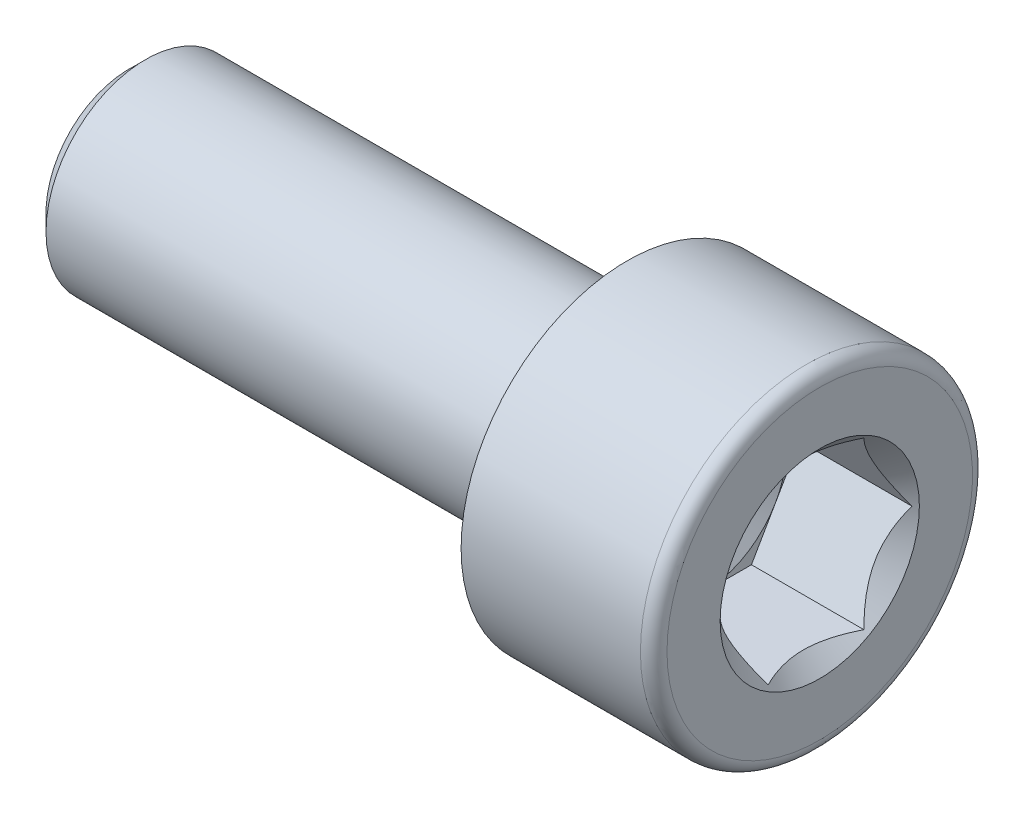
ISO-10303-21;
HEADER;
FILE_DESCRIPTION(('STEP AP214'),'2;1');
FILE_NAME('part.step','',(''),(''),'','','');
FILE_SCHEMA(('AUTOMOTIVE_DESIGN { 1 0 10303 214 1 1 1 1 }'));
ENDSEC;
DATA;
#1=APPLICATION_CONTEXT('core data for automotive mechanical design processes');
#2=APPLICATION_PROTOCOL_DEFINITION('international standard','automotive_design',2000,#1);
#3=PRODUCT_CONTEXT('',#1,'mechanical');
#4=PRODUCT('Part','Part','',(#3));
#5=PRODUCT_RELATED_PRODUCT_CATEGORY('part','',(#4));
#6=PRODUCT_DEFINITION_FORMATION('','',#4);
#7=PRODUCT_DEFINITION_CONTEXT('part definition',#1,'design');
#8=PRODUCT_DEFINITION('design','',#6,#7);
#9=PRODUCT_DEFINITION_SHAPE('','',#8);
#10=(LENGTH_UNIT() NAMED_UNIT(*) SI_UNIT(.MILLI.,.METRE.));
#11=(NAMED_UNIT(*) PLANE_ANGLE_UNIT() SI_UNIT($,.RADIAN.));
#12=(NAMED_UNIT(*) SI_UNIT($,.STERADIAN.) SOLID_ANGLE_UNIT());
#13=UNCERTAINTY_MEASURE_WITH_UNIT(LENGTH_MEASURE(1.E-05),#10,'distance_accuracy_value','');
#14=(GEOMETRIC_REPRESENTATION_CONTEXT(3) GLOBAL_UNCERTAINTY_ASSIGNED_CONTEXT((#13)) GLOBAL_UNIT_ASSIGNED_CONTEXT((#10,
#11,#12)) REPRESENTATION_CONTEXT('',''));
#15=CARTESIAN_POINT('',(0.,0.,0.));
#16=DIRECTION('',(0.,0.,1.));
#17=DIRECTION('',(1.,0.,0.));
#18=AXIS2_PLACEMENT_3D('',#15,#16,#17);
#19=CARTESIAN_POINT('',(-30.,0.,0.));
#20=DIRECTION('',(-1.,0.,0.));
#21=DIRECTION('',(0.,0.,1.));
#22=AXIS2_PLACEMENT_3D('',#19,#20,#21);
#23=CYLINDRICAL_SURFACE('',#22,3.);
#24=CARTESIAN_POINT('',(-14.5,0.,0.));
#25=DIRECTION('',(1.,0.,0.));
#26=DIRECTION('',(0.,0.,-1.));
#27=AXIS2_PLACEMENT_3D('',#24,#25,#26);
#28=CIRCLE('',#27,3.);
#29=CARTESIAN_POINT('',(-14.5,0.,-3.));
#30=VERTEX_POINT('',#29);
#31=EDGE_CURVE('E11',#30,#30,#28,.T.);
#32=ORIENTED_EDGE('',*,*,#31,.T.);
#33=EDGE_LOOP('',(#32));
#34=FACE_BOUND('',#33,.T.);
#35=CARTESIAN_POINT('',(0.,0.,0.));
#36=DIRECTION('',(-1.,0.,0.));
#37=DIRECTION('',(0.,0.,1.));
#38=AXIS2_PLACEMENT_3D('',#35,#36,#37);
#39=CIRCLE('',#38,3.);
#40=CARTESIAN_POINT('',(0.,0.,3.));
#41=VERTEX_POINT('',#40);
#42=EDGE_CURVE('E461',#41,#41,#39,.T.);
#43=ORIENTED_EDGE('',*,*,#42,.T.);
#44=EDGE_LOOP('',(#43));
#45=FACE_BOUND('',#44,.T.);
#46=ADVANCED_FACE('F348',(#34,#45),#23,.T.);
#47=CARTESIAN_POINT('',(-14.9999999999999,0.,0.));
#48=DIRECTION('',(1.,0.,0.));
#49=DIRECTION('',(0.,0.,-1.));
#50=AXIS2_PLACEMENT_3D('',#47,#48,#49);
#51=PLANE('',#50);
#52=CARTESIAN_POINT('',(-14.9999999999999,0.,0.));
#53=DIRECTION('',(1.,0.,0.));
#54=DIRECTION('',(0.,0.,-1.));
#55=AXIS2_PLACEMENT_3D('',#52,#53,#54);
#56=CIRCLE('',#55,2.5);
#57=CARTESIAN_POINT('',(-14.9999999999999,0.,-2.5));
#58=VERTEX_POINT('',#57);
#59=EDGE_CURVE('E355',#58,#58,#56,.F.);
#60=ORIENTED_EDGE('',*,*,#59,.T.);
#61=EDGE_LOOP('',(#60));
#62=FACE_BOUND('',#61,.T.);
#63=ADVANCED_FACE('F535',(#62),#51,.F.);
#64=CARTESIAN_POINT('',(5.29999999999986,0.,0.));
#65=DIRECTION('',(1.,0.,0.));
#66=DIRECTION('',(0.,0.,-1.));
#67=AXIS2_PLACEMENT_3D('',#64,#65,#66);
#68=CONICAL_SURFACE('',#67,2.5,0.785398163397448);
#69=CARTESIAN_POINT('',(5.79999999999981,0.,0.));
#70=DIRECTION('',(-1.,0.,0.));
#71=DIRECTION('',(0.,0.,1.));
#72=AXIS2_PLACEMENT_3D('',#69,#70,#71);
#73=CIRCLE('',#72,3.);
#74=CARTESIAN_POINT('',(5.79999999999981,0.,3.));
#75=VERTEX_POINT('',#74);
#76=EDGE_CURVE('E484',#75,#75,#73,.T.);
#77=ORIENTED_EDGE('',*,*,#76,.F.);
#78=EDGE_LOOP('',(#77));
#79=FACE_BOUND('',#78,.T.);
#80=CARTESIAN_POINT('',(5.68686682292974,-2.50020000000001,1.44326020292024));
#81=CARTESIAN_POINT('',(5.63729205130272,-2.41426172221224,1.49287669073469));
#82=CARTESIAN_POINT('',(5.5906288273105,-2.32688643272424,1.5433228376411));
#83=CARTESIAN_POINT('',(5.50518948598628,-2.1487185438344,1.6461881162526));
#84=CARTESIAN_POINT('',(5.46646090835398,-2.05790899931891,1.69861703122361));
#85=CARTESIAN_POINT('',(5.40011804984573,-1.87479587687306,1.80433744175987));
#86=CARTESIAN_POINT('',(5.37233701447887,-1.78253893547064,1.85760201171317));
#87=CARTESIAN_POINT('',(5.32953452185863,-1.5959939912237,1.9653037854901));
#88=CARTESIAN_POINT('',(5.31448111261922,-1.50171168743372,2.01973769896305));
#89=CARTESIAN_POINT('',(5.30089906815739,-1.33922174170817,2.11355131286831));
#90=CARTESIAN_POINT('',(5.29888844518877,-1.27122403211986,2.1528098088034));
#91=CARTESIAN_POINT('',(5.3022754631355,-1.1353397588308,2.23126263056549));
#92=CARTESIAN_POINT('',(5.30767570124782,-1.06745324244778,2.27045692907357));
#93=CARTESIAN_POINT('',(5.32557713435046,-0.932321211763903,2.34847544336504));
#94=CARTESIAN_POINT('',(5.33808627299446,-0.865076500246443,2.38729919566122));
#95=CARTESIAN_POINT('',(5.3695188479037,-0.731749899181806,2.46427534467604));
#96=CARTESIAN_POINT('',(5.38844179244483,-0.665667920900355,2.50242779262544));
#97=CARTESIAN_POINT('',(5.44461870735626,-0.496403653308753,2.60015256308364));
#98=CARTESIAN_POINT('',(5.48610717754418,-0.394270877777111,2.65911894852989));
#99=CARTESIAN_POINT('',(5.55614539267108,-0.244093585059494,2.74582384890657));
#100=CARTESIAN_POINT('',(5.58075359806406,-0.194603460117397,2.77439698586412));
#101=CARTESIAN_POINT('',(5.63221323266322,-0.0965399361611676,2.83101398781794));
#102=CARTESIAN_POINT('',(5.65906328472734,-0.047965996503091,2.85905816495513));
#103=CARTESIAN_POINT('',(5.68686682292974,0.000199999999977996,2.88686681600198));
#104=B_SPLINE_CURVE_WITH_KNOTS('',3,(#80,#81,#82,#83,#84,#85,#86,#87,#88,#89,#90,#91,#92,#93,
#94,#95,#96,#97,#98,#99,#100,#101,#102,#103),.UNSPECIFIED.,.F.,.F.,(4,2,2,2,2,2,2,2,2,2,2,4),
(0.,0.333012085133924,0.667964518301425,0.997597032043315,1.32639954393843,1.56169424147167,
1.79707142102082,2.03271213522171,2.26833478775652,2.64260240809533,2.82922877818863,
3.01574133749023),.UNSPECIFIED.);
#105=CARTESIAN_POINT('',(5.68675134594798,-2.5,1.44337567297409));
#106=VERTEX_POINT('',#105);
#107=CARTESIAN_POINT('',(5.68675134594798,0.,2.88675134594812));
#108=VERTEX_POINT('',#107);
#109=EDGE_CURVE('E489',#106,#108,#104,.T.);
#110=ORIENTED_EDGE('',*,*,#109,.T.);
#111=CARTESIAN_POINT('',(5.68686682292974,-0.000200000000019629,2.88686681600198));
#112=CARTESIAN_POINT('',(5.63729205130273,0.0857382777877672,2.83725032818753));
#113=CARTESIAN_POINT('',(5.59062882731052,0.173113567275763,2.78680418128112));
#114=CARTESIAN_POINT('',(5.50518948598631,0.351281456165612,2.68393890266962));
#115=CARTESIAN_POINT('',(5.46646090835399,0.442091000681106,2.63150998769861));
#116=CARTESIAN_POINT('',(5.40011804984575,0.625204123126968,2.52578957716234));
#117=CARTESIAN_POINT('',(5.3723370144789,0.717461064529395,2.47252500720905));
#118=CARTESIAN_POINT('',(5.32953452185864,0.904006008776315,2.3648232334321));
#119=CARTESIAN_POINT('',(5.31448111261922,0.998288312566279,2.3103893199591));
#120=CARTESIAN_POINT('',(5.30089906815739,1.16077825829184,2.21657570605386));
#121=CARTESIAN_POINT('',(5.29888844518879,1.22877596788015,2.17731721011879));
#122=CARTESIAN_POINT('',(5.30227546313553,1.36466024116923,2.09886438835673));
#123=CARTESIAN_POINT('',(5.30767570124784,1.43254675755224,2.05967008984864));
#124=CARTESIAN_POINT('',(5.32557713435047,1.56767878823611,1.98165157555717));
#125=CARTESIAN_POINT('',(5.33808627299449,1.63492349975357,1.94282782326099));
#126=CARTESIAN_POINT('',(5.36951884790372,1.7682501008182,1.86585167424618));
#127=CARTESIAN_POINT('',(5.38844179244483,1.83433207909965,1.82769922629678));
#128=CARTESIAN_POINT('',(5.44461870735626,2.00359634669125,1.72997445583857));
#129=CARTESIAN_POINT('',(5.48610717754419,2.10572912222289,1.67100807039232));
#130=CARTESIAN_POINT('',(5.55614539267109,2.25590641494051,1.58430317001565));
#131=CARTESIAN_POINT('',(5.58075359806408,2.30539653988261,1.5557300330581));
#132=CARTESIAN_POINT('',(5.63221323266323,2.40346006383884,1.49911303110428));
#133=CARTESIAN_POINT('',(5.65906328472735,2.45203400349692,1.47106885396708));
#134=CARTESIAN_POINT('',(5.68686682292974,2.50019999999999,1.44326020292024));
#135=B_SPLINE_CURVE_WITH_KNOTS('',3,(#111,#112,#113,#114,#115,#116,#117,#118,#119,#120,#121,
#122,#123,#124,#125,#126,#127,#128,#129,#130,#131,#132,#133,#134),.UNSPECIFIED.,.F.,.F.,(4,2,2,
2,2,2,2,2,2,2,2,4),(0.,0.333012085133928,0.66796451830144,0.997597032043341,1.32639954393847,
1.5616942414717,1.79707142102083,2.03271213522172,2.26833478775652,2.64260240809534,
2.82922877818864,3.01574133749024),.UNSPECIFIED.);
#136=CARTESIAN_POINT('',(5.68675134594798,2.5,1.44337567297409));
#137=VERTEX_POINT('',#136);
#138=EDGE_CURVE('E370',#108,#137,#135,.T.);
#139=ORIENTED_EDGE('',*,*,#138,.T.);
#140=CARTESIAN_POINT('',(6.74994835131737,2.5,-3.05811902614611));
#141=CARTESIAN_POINT('',(6.6928941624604,2.5,-2.98440983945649));
#142=CARTESIAN_POINT('',(6.63633840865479,2.5,-2.91030875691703));
#143=CARTESIAN_POINT('',(6.52445299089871,2.5,-2.7611607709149));
#144=CARTESIAN_POINT('',(6.46912361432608,2.5,-2.68611365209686));
#145=CARTESIAN_POINT('',(6.35952665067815,2.5,-2.53436379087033));
#146=CARTESIAN_POINT('',(6.3052705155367,2.5,-2.45765275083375));
#147=CARTESIAN_POINT('',(6.19860260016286,2.5,-2.30296317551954));
#148=CARTESIAN_POINT('',(6.1461906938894,2.5,-2.22498472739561));
#149=CARTESIAN_POINT('',(6.04026321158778,2.5,-2.0623676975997));
#150=CARTESIAN_POINT('',(5.98690162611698,2.5,-1.97762830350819));
#151=CARTESIAN_POINT('',(5.88344307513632,2.5,-1.80618229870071));
#152=CARTESIAN_POINT('',(5.83334568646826,2.5,-1.71947594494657));
#153=CARTESIAN_POINT('',(5.73745253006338,2.5,-1.5440239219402));
#154=CARTESIAN_POINT('',(5.6916447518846,2.5,-1.4552848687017));
#155=CARTESIAN_POINT('',(5.6053657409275,2.5,-1.27526975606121));
#156=CARTESIAN_POINT('',(5.56489195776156,2.5,-1.18399493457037));
#157=CARTESIAN_POINT('',(5.49462825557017,2.5,-1.00836471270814));
#158=CARTESIAN_POINT('',(5.46416406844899,2.5,-0.924281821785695));
#159=CARTESIAN_POINT('',(5.40996243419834,2.5,-0.753934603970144));
#160=CARTESIAN_POINT('',(5.38622540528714,2.5,-0.6676701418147));
#161=CARTESIAN_POINT('',(5.3471752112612,2.5,-0.495001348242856));
#162=CARTESIAN_POINT('',(5.33170602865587,2.5,-0.408632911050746));
#163=CARTESIAN_POINT('',(5.30952108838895,2.5,-0.234772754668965));
#164=CARTESIAN_POINT('',(5.30280339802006,2.5,-0.147281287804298));
#165=CARTESIAN_POINT('',(5.29871822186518,2.5,0.023851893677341));
#166=CARTESIAN_POINT('',(5.30093086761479,2.5,0.107483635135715));
#167=CARTESIAN_POINT('',(5.31360968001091,2.5,0.274114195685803));
#168=CARTESIAN_POINT('',(5.32407657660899,2.5,0.357112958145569));
#169=CARTESIAN_POINT('',(5.35284213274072,2.5,0.523288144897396));
#170=CARTESIAN_POINT('',(5.37128080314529,2.5,0.606439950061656));
#171=CARTESIAN_POINT('',(5.41495620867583,2.5,0.770896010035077));
#172=CARTESIAN_POINT('',(5.44019262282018,2.5,0.852200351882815));
#173=CARTESIAN_POINT('',(5.52700067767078,2.5,1.1006462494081));
#174=CARTESIAN_POINT('',(5.59813375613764,2.5,1.26445670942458));
#175=CARTESIAN_POINT('',(5.71682012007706,2.5,1.50421272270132));
#176=CARTESIAN_POINT('',(5.75847161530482,2.5,1.58328419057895));
#177=CARTESIAN_POINT('',(5.84501240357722,2.5,1.73963927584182));
#178=CARTESIAN_POINT('',(5.88990113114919,2.5,1.81692320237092));
#179=CARTESIAN_POINT('',(5.97999121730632,2.5,1.96613896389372));
#180=CARTESIAN_POINT('',(6.02506807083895,2.5,2.03814682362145));
#181=CARTESIAN_POINT('',(6.1171473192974,2.5,2.18092679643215));
#182=CARTESIAN_POINT('',(6.16414985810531,2.5,2.25169881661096));
#183=CARTESIAN_POINT('',(6.25935501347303,2.5,2.39159945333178));
#184=CARTESIAN_POINT('',(6.30754501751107,2.5,2.46073668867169));
#185=CARTESIAN_POINT('',(6.40522114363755,2.5,2.59806183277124));
#186=CARTESIAN_POINT('',(6.45470690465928,2.5,2.66624999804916));
#187=CARTESIAN_POINT('',(6.50472334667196,2.49999999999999,2.73404006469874));
#188=B_SPLINE_CURVE_WITH_KNOTS('',3,(#140,#141,#142,#143,#144,#145,#146,#147,#148,#149,#150,
#151,#152,#153,#154,#155,#156,#157,#158,#159,#160,#161,#162,#163,#164,#165,#166,#167,#168,#169,
#170,#171,#172,#173,#174,#175,#176,#177,#178,#179,#180,#181,#182,#183,#184,#185,#186,#187),
.UNSPECIFIED.,.F.,.F.,(4,2,2,2,2,2,2,2,2,2,2,2,2,2,2,2,2,2,2,2,2,2,2,4),(0.,0.279636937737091,
0.559338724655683,0.841193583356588,1.1230291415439,1.42339426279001,1.72372036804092,
2.02317874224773,2.3224934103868,2.5905581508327,2.85863955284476,3.12146553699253,
3.38423346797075,3.63479445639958,3.88537760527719,4.14055298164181,4.39571631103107,
4.92983151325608,5.19792074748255,5.46596326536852,5.72079181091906,5.97563943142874,
6.2284477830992,6.4811864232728),.UNSPECIFIED.);
#189=CARTESIAN_POINT('',(5.68675134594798,2.5,-1.44337567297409));
#190=VERTEX_POINT('',#189);
#191=EDGE_CURVE('E526',#137,#190,#188,.F.);
#192=ORIENTED_EDGE('',*,*,#191,.T.);
#193=CARTESIAN_POINT('',(5.68686682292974,2.50019999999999,-1.44326020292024));
#194=CARTESIAN_POINT('',(5.63729205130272,2.41426172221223,-1.49287669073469));
#195=CARTESIAN_POINT('',(5.5906288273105,2.32688643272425,-1.54332283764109));
#196=CARTESIAN_POINT('',(5.50518948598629,2.14871854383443,-1.64618811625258));
#197=CARTESIAN_POINT('',(5.46646090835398,2.05790899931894,-1.69861703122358));
#198=CARTESIAN_POINT('',(5.40011804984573,1.87479587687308,-1.80433744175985));
#199=CARTESIAN_POINT('',(5.37233701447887,1.78253893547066,-1.85760201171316));
#200=CARTESIAN_POINT('',(5.32953452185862,1.59599399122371,-1.96530378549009));
#201=CARTESIAN_POINT('',(5.31448111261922,1.50171168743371,-2.01973769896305));
#202=CARTESIAN_POINT('',(5.30089906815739,1.33922174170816,-2.11355131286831));
#203=CARTESIAN_POINT('',(5.29888844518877,1.27122403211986,-2.1528098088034));
#204=CARTESIAN_POINT('',(5.30227546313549,1.1353397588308,-2.23126263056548));
#205=CARTESIAN_POINT('',(5.3076757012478,1.06745324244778,-2.27045692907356));
#206=CARTESIAN_POINT('',(5.32557713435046,0.932321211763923,-2.34847544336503));
#207=CARTESIAN_POINT('',(5.3380862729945,0.865076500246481,-2.3872991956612));
#208=CARTESIAN_POINT('',(5.36951884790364,0.731749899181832,-2.46427534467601));
#209=CARTESIAN_POINT('',(5.38844179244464,0.665667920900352,-2.50242779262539));
#210=CARTESIAN_POINT('',(5.444618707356,0.496403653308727,-2.60015256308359));
#211=CARTESIAN_POINT('',(5.48610717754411,0.394270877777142,-2.65911894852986));
#212=CARTESIAN_POINT('',(5.55614539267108,0.244093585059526,-2.74582384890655));
#213=CARTESIAN_POINT('',(5.58075359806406,0.194603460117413,-2.7743969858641));
#214=CARTESIAN_POINT('',(5.63221323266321,0.0965399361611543,-2.83101398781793));
#215=CARTESIAN_POINT('',(5.65906328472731,0.0479659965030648,-2.85905816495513));
#216=CARTESIAN_POINT('',(5.68686682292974,-0.000200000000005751,-2.88686681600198));
#217=B_SPLINE_CURVE_WITH_KNOTS('',3,(#193,#194,#195,#196,#197,#198,#199,#200,#201,#202,#203,
#204,#205,#206,#207,#208,#209,#210,#211,#212,#213,#214,#215,#216),.UNSPECIFIED.,.F.,.F.,(4,2,2,
2,2,2,2,2,2,2,2,4),(0.,0.333012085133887,0.667964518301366,0.997597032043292,1.32639954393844,
1.56169424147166,1.79707142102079,2.03271213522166,2.26833478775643,2.64260240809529,
2.82922877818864,3.01574133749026),.UNSPECIFIED.);
#218=CARTESIAN_POINT('',(5.68675134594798,0.,-2.88675134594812));
#219=VERTEX_POINT('',#218);
#220=EDGE_CURVE('E610',#190,#219,#217,.T.);
#221=ORIENTED_EDGE('',*,*,#220,.T.);
#222=CARTESIAN_POINT('',(5.68686682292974,0.000199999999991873,-2.88686681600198));
#223=CARTESIAN_POINT('',(5.6372920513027,-0.0857382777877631,-2.8372503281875));
#224=CARTESIAN_POINT('',(5.59062882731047,-0.173113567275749,-2.78680418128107));
#225=CARTESIAN_POINT('',(5.50518948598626,-0.351281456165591,-2.68393890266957));
#226=CARTESIAN_POINT('',(5.46646090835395,-0.442091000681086,-2.63150998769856));
#227=CARTESIAN_POINT('',(5.4001180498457,-0.625204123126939,-2.5257895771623));
#228=CARTESIAN_POINT('',(5.37233701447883,-0.717461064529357,-2.472525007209));
#229=CARTESIAN_POINT('',(5.3295345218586,-0.904006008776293,-2.36482323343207));
#230=CARTESIAN_POINT('',(5.31448111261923,-0.998288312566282,-2.31038931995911));
#231=CARTESIAN_POINT('',(5.30089906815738,-1.16077825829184,-2.21657570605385));
#232=CARTESIAN_POINT('',(5.29888844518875,-1.22877596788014,-2.17731721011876));
#233=CARTESIAN_POINT('',(5.30227546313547,-1.3646602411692,-2.09886438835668));
#234=CARTESIAN_POINT('',(5.30767570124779,-1.43254675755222,-2.0596700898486));
#235=CARTESIAN_POINT('',(5.32557713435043,-1.56767878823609,-1.98165157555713));
#236=CARTESIAN_POINT('',(5.33808627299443,-1.63492349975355,-1.94282782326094));
#237=CARTESIAN_POINT('',(5.36951884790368,-1.76825010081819,-1.86585167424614));
#238=CARTESIAN_POINT('',(5.38844179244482,-1.83433207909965,-1.82769922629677));
#239=CARTESIAN_POINT('',(5.44461870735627,-2.00359634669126,-1.72997445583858));
#240=CARTESIAN_POINT('',(5.48610717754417,-2.10572912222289,-1.67100807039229));
#241=CARTESIAN_POINT('',(5.55614539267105,-2.25590641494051,-1.58430317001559));
#242=CARTESIAN_POINT('',(5.58075359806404,-2.3053965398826,-1.55573003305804));
#243=CARTESIAN_POINT('',(5.63221323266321,-2.40346006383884,-1.49911303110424));
#244=CARTESIAN_POINT('',(5.65906328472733,-2.45203400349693,-1.47106885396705));
#245=CARTESIAN_POINT('',(5.68686682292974,-2.50020000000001,-1.44326020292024));
#246=B_SPLINE_CURVE_WITH_KNOTS('',3,(#222,#223,#224,#225,#226,#227,#228,#229,#230,#231,#232,
#233,#234,#235,#236,#237,#238,#239,#240,#241,#242,#243,#244,#245),.UNSPECIFIED.,.F.,.F.,(4,2,2,
2,2,2,2,2,2,2,2,4),(0.,0.333012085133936,0.667964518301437,0.99759703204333,1.32639954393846,
1.56169424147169,1.79707142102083,2.03271213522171,2.26833478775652,2.64260240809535,
2.82922877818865,3.01574133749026),.UNSPECIFIED.);
#247=CARTESIAN_POINT('',(5.68675134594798,-2.5,-1.44337567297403));
#248=VERTEX_POINT('',#247);
#249=EDGE_CURVE('E611',#219,#248,#246,.T.);
#250=ORIENTED_EDGE('',*,*,#249,.T.);
#251=CARTESIAN_POINT('',(6.74994835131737,-2.5,-3.05811902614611));
#252=CARTESIAN_POINT('',(6.6928941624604,-2.5,-2.98440983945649));
#253=CARTESIAN_POINT('',(6.63633840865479,-2.5,-2.91030875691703));
#254=CARTESIAN_POINT('',(6.52445299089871,-2.5,-2.7611607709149));
#255=CARTESIAN_POINT('',(6.46912361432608,-2.5,-2.68611365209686));
#256=CARTESIAN_POINT('',(6.35952665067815,-2.5,-2.53436379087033));
#257=CARTESIAN_POINT('',(6.3052705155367,-2.5,-2.45765275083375));
#258=CARTESIAN_POINT('',(6.19860260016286,-2.5,-2.30296317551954));
#259=CARTESIAN_POINT('',(6.1461906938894,-2.5,-2.22498472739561));
#260=CARTESIAN_POINT('',(6.04026321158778,-2.5,-2.0623676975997));
#261=CARTESIAN_POINT('',(5.98690162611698,-2.5,-1.97762830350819));
#262=CARTESIAN_POINT('',(5.88344307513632,-2.5,-1.80618229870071));
#263=CARTESIAN_POINT('',(5.83334568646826,-2.5,-1.71947594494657));
#264=CARTESIAN_POINT('',(5.73745253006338,-2.5,-1.5440239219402));
#265=CARTESIAN_POINT('',(5.6916447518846,-2.5,-1.4552848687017));
#266=CARTESIAN_POINT('',(5.6053657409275,-2.5,-1.27526975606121));
#267=CARTESIAN_POINT('',(5.56489195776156,-2.5,-1.18399493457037));
#268=CARTESIAN_POINT('',(5.49462825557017,-2.5,-1.00836471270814));
#269=CARTESIAN_POINT('',(5.46416406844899,-2.5,-0.924281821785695));
#270=CARTESIAN_POINT('',(5.40996243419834,-2.5,-0.753934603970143));
#271=CARTESIAN_POINT('',(5.38622540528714,-2.5,-0.6676701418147));
#272=CARTESIAN_POINT('',(5.3471752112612,-2.5,-0.495001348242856));
#273=CARTESIAN_POINT('',(5.33170602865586,-2.5,-0.408632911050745));
#274=CARTESIAN_POINT('',(5.30952108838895,-2.5,-0.234772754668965));
#275=CARTESIAN_POINT('',(5.30280339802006,-2.5,-0.147281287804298));
#276=CARTESIAN_POINT('',(5.29871822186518,-2.5,0.023851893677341));
#277=CARTESIAN_POINT('',(5.30093086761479,-2.5,0.107483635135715));
#278=CARTESIAN_POINT('',(5.31360968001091,-2.5,0.274114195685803));
#279=CARTESIAN_POINT('',(5.32407657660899,-2.5,0.357112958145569));
#280=CARTESIAN_POINT('',(5.35284213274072,-2.5,0.523288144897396));
#281=CARTESIAN_POINT('',(5.37128080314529,-2.5,0.606439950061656));
#282=CARTESIAN_POINT('',(5.41495620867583,-2.5,0.770896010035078));
#283=CARTESIAN_POINT('',(5.44019262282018,-2.5,0.852200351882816));
#284=CARTESIAN_POINT('',(5.52700067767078,-2.5,1.1006462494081));
#285=CARTESIAN_POINT('',(5.59813375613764,-2.5,1.26445670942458));
#286=CARTESIAN_POINT('',(5.71682012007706,-2.5,1.50421272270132));
#287=CARTESIAN_POINT('',(5.75847161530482,-2.5,1.58328419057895));
#288=CARTESIAN_POINT('',(5.84501240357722,-2.5,1.73963927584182));
#289=CARTESIAN_POINT('',(5.88990113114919,-2.5,1.81692320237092));
#290=CARTESIAN_POINT('',(5.97999121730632,-2.5,1.96613896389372));
#291=CARTESIAN_POINT('',(6.02506807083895,-2.5,2.03814682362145));
#292=CARTESIAN_POINT('',(6.1171473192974,-2.5,2.18092679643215));
#293=CARTESIAN_POINT('',(6.16414985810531,-2.5,2.25169881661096));
#294=CARTESIAN_POINT('',(6.25935501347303,-2.5,2.39159945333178));
#295=CARTESIAN_POINT('',(6.30754501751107,-2.5,2.46073668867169));
#296=CARTESIAN_POINT('',(6.40522114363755,-2.5,2.59806183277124));
#297=CARTESIAN_POINT('',(6.45470690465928,-2.50000000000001,2.66624999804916));
#298=CARTESIAN_POINT('',(6.50472334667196,-2.50000000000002,2.73404006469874));
#299=B_SPLINE_CURVE_WITH_KNOTS('',3,(#251,#252,#253,#254,#255,#256,#257,#258,#259,#260,#261,
#262,#263,#264,#265,#266,#267,#268,#269,#270,#271,#272,#273,#274,#275,#276,#277,#278,#279,#280,
#281,#282,#283,#284,#285,#286,#287,#288,#289,#290,#291,#292,#293,#294,#295,#296,#297,#298),
.UNSPECIFIED.,.F.,.F.,(4,2,2,2,2,2,2,2,2,2,2,2,2,2,2,2,2,2,2,2,2,2,2,4),(0.,0.279636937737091,
0.559338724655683,0.841193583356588,1.1230291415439,1.42339426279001,1.72372036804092,
2.02317874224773,2.3224934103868,2.5905581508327,2.85863955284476,3.12146553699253,
3.38423346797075,3.63479445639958,3.88537760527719,4.14055298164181,4.39571631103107,
4.92983151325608,5.19792074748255,5.46596326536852,5.72079181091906,5.97563943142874,
6.2284477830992,6.4811864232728),.UNSPECIFIED.);
#300=EDGE_CURVE('E497',#248,#106,#299,.T.);
#301=ORIENTED_EDGE('',*,*,#300,.T.);
#302=EDGE_LOOP('',(#110,#139,#192,#221,#250,#301));
#303=FACE_BOUND('',#302,.T.);
#304=ADVANCED_FACE('F503',(#79,#303),#68,.F.);
#305=CARTESIAN_POINT('',(5.79999999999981,4.60000000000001,0.));
#306=DIRECTION('',(-1.,0.,0.));
#307=DIRECTION('',(0.,0.,1.));
#308=AXIS2_PLACEMENT_3D('',#305,#306,#307);
#309=PLANE('',#308);
#310=CARTESIAN_POINT('',(5.79999999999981,0.,0.));
#311=DIRECTION('',(-1.,0.,0.));
#312=DIRECTION('',(0.,0.,1.));
#313=AXIS2_PLACEMENT_3D('',#310,#311,#312);
#314=CIRCLE('',#313,4.6);
#315=CARTESIAN_POINT('',(5.79999999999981,0.,4.6));
#316=VERTEX_POINT('',#315);
#317=EDGE_CURVE('E481',#316,#316,#314,.T.);
#318=ORIENTED_EDGE('',*,*,#317,.F.);
#319=EDGE_LOOP('',(#318));
#320=FACE_BOUND('',#319,.T.);
#321=ORIENTED_EDGE('',*,*,#76,.T.);
#322=EDGE_LOOP('',(#321));
#323=FACE_BOUND('',#322,.T.);
#324=ADVANCED_FACE('F570',(#320,#323),#309,.F.);
#325=CARTESIAN_POINT('',(5.39999999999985,0.,0.));
#326=DIRECTION('',(-1.,0.,0.));
#327=DIRECTION('',(0.,0.,1.));
#328=AXIS2_PLACEMENT_3D('',#325,#326,#327);
#329=TOROIDAL_SURFACE('',#328,4.6,0.4);
#330=CARTESIAN_POINT('',(5.39999999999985,0.,0.));
#331=DIRECTION('',(-1.,0.,0.));
#332=DIRECTION('',(0.,0.,1.));
#333=AXIS2_PLACEMENT_3D('',#330,#331,#332);
#334=CIRCLE('',#333,5.);
#335=CARTESIAN_POINT('',(5.39999999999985,0.,5.));
#336=VERTEX_POINT('',#335);
#337=EDGE_CURVE('E478',#336,#336,#334,.T.);
#338=ORIENTED_EDGE('',*,*,#337,.F.);
#339=EDGE_LOOP('',(#338));
#340=FACE_BOUND('',#339,.T.);
#341=ORIENTED_EDGE('',*,*,#317,.T.);
#342=EDGE_LOOP('',(#341));
#343=FACE_BOUND('',#342,.T.);
#344=ADVANCED_FACE('F565',(#340,#343),#329,.T.);
#345=CARTESIAN_POINT('',(-30.,0.,0.));
#346=DIRECTION('',(-1.,0.,0.));
#347=DIRECTION('',(0.,0.,1.));
#348=AXIS2_PLACEMENT_3D('',#345,#346,#347);
#349=CYLINDRICAL_SURFACE('',#348,5.);
#350=CARTESIAN_POINT('',(0.,0.,0.));
#351=DIRECTION('',(-1.,0.,0.));
#352=DIRECTION('',(0.,0.,1.));
#353=AXIS2_PLACEMENT_3D('',#350,#351,#352);
#354=CIRCLE('',#353,5.);
#355=CARTESIAN_POINT('',(0.,0.,5.));
#356=VERTEX_POINT('',#355);
#357=EDGE_CURVE('E475',#356,#356,#354,.T.);
#358=ORIENTED_EDGE('',*,*,#357,.F.);
#359=EDGE_LOOP('',(#358));
#360=FACE_BOUND('',#359,.T.);
#361=ORIENTED_EDGE('',*,*,#337,.T.);
#362=EDGE_LOOP('',(#361));
#363=FACE_BOUND('',#362,.T.);
#364=ADVANCED_FACE('F560',(#360,#363),#349,.T.);
#365=CARTESIAN_POINT('',(0.,3.,0.));
#366=DIRECTION('',(1.,0.,0.));
#367=DIRECTION('',(0.,0.,-1.));
#368=AXIS2_PLACEMENT_3D('',#365,#366,#367);
#369=PLANE('',#368);
#370=ORIENTED_EDGE('',*,*,#42,.F.);
#371=EDGE_LOOP('',(#370));
#372=FACE_BOUND('',#371,.T.);
#373=ORIENTED_EDGE('',*,*,#357,.T.);
#374=EDGE_LOOP('',(#373));
#375=FACE_BOUND('',#374,.T.);
#376=ADVANCED_FACE('F519',(#372,#375),#369,.F.);
#377=CARTESIAN_POINT('',(2.29999999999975,0.,2.88675134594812));
#378=DIRECTION('',(1.,0.,0.));
#379=DIRECTION('',(0.,0.,-1.));
#380=AXIS2_PLACEMENT_3D('',#377,#378,#379);
#381=PLANE('',#380);
#382=CARTESIAN_POINT('',(2.29999999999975,0.,0.));
#383=DIRECTION('',(-1.,0.,0.));
#384=DIRECTION('',(0.,0.,1.));
#385=AXIS2_PLACEMENT_3D('',#382,#383,#384);
#386=CIRCLE('',#385,2.5);
#387=CARTESIAN_POINT('',(2.29999999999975,-1.25,-2.16506350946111));
#388=VERTEX_POINT('',#387);
#389=CARTESIAN_POINT('',(2.29999999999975,-2.5,0.));
#390=VERTEX_POINT('',#389);
#391=EDGE_CURVE('E594',#388,#390,#386,.T.);
#392=ORIENTED_EDGE('',*,*,#391,.T.);
#393=DIRECTION('',(0.,0.,-1.));
#394=VECTOR('',#393,1.);
#395=CARTESIAN_POINT('',(2.29999999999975,-2.5,1.44337567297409));
#396=LINE('',#395,#394);
#397=CARTESIAN_POINT('',(2.29999999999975,-2.5,-1.44337567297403));
#398=VERTEX_POINT('',#397);
#399=EDGE_CURVE('E444',#390,#398,#396,.T.);
#400=ORIENTED_EDGE('',*,*,#399,.T.);
#401=DIRECTION('',(0.,0.866025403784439,-0.5));
#402=VECTOR('',#401,1.);
#403=CARTESIAN_POINT('',(2.29999999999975,-2.5,-1.44337567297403));
#404=LINE('',#403,#402);
#405=EDGE_CURVE('E451',#398,#388,#404,.T.);
#406=ORIENTED_EDGE('',*,*,#405,.T.);
#407=EDGE_LOOP('',(#392,#400,#406));
#408=FACE_BOUND('',#407,.T.);
#409=ADVANCED_FACE('F559',(#408),#381,.T.);
#410=CARTESIAN_POINT('',(2.29999999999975,-1.25,2.16506350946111));
#411=VERTEX_POINT('',#410);
#412=EDGE_CURVE('E589',#390,#411,#386,.T.);
#413=ORIENTED_EDGE('',*,*,#412,.T.);
#414=DIRECTION('',(0.,-0.866025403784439,-0.5));
#415=VECTOR('',#414,1.);
#416=CARTESIAN_POINT('',(2.29999999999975,0.,2.88675134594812));
#417=LINE('',#416,#415);
#418=CARTESIAN_POINT('',(2.29999999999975,-2.5,1.44337567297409));
#419=VERTEX_POINT('',#418);
#420=EDGE_CURVE('E443',#411,#419,#417,.T.);
#421=ORIENTED_EDGE('',*,*,#420,.T.);
#422=EDGE_CURVE('E446',#419,#390,#396,.T.);
#423=ORIENTED_EDGE('',*,*,#422,.T.);
#424=EDGE_LOOP('',(#413,#421,#423));
#425=FACE_BOUND('',#424,.T.);
#426=ADVANCED_FACE('F588',(#425),#381,.T.);
#427=CARTESIAN_POINT('',(2.29999999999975,1.25,2.16506350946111));
#428=VERTEX_POINT('',#427);
#429=EDGE_CURVE('E428',#411,#428,#386,.T.);
#430=ORIENTED_EDGE('',*,*,#429,.T.);
#431=DIRECTION('',(0.,-0.866025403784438,0.5));
#432=VECTOR('',#431,1.);
#433=CARTESIAN_POINT('',(2.29999999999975,2.5,1.44337567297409));
#434=LINE('',#433,#432);
#435=CARTESIAN_POINT('',(2.29999999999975,0.,2.88675134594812));
#436=VERTEX_POINT('',#435);
#437=EDGE_CURVE('E423',#428,#436,#434,.T.);
#438=ORIENTED_EDGE('',*,*,#437,.T.);
#439=EDGE_CURVE('E426',#436,#411,#417,.T.);
#440=ORIENTED_EDGE('',*,*,#439,.T.);
#441=EDGE_LOOP('',(#430,#438,#440));
#442=FACE_BOUND('',#441,.T.);
#443=ADVANCED_FACE('F424',(#442),#381,.T.);
#444=CARTESIAN_POINT('',(2.29999999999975,2.5,0.));
#445=VERTEX_POINT('',#444);
#446=EDGE_CURVE('E487',#428,#445,#386,.T.);
#447=ORIENTED_EDGE('',*,*,#446,.T.);
#448=DIRECTION('',(0.,0.,1.));
#449=VECTOR('',#448,1.);
#450=CARTESIAN_POINT('',(2.29999999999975,2.5,-1.44337567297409));
#451=LINE('',#450,#449);
#452=CARTESIAN_POINT('',(2.29999999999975,2.5,1.44337567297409));
#453=VERTEX_POINT('',#452);
#454=EDGE_CURVE('E456',#445,#453,#451,.T.);
#455=ORIENTED_EDGE('',*,*,#454,.T.);
#456=EDGE_CURVE('E431',#453,#428,#434,.T.);
#457=ORIENTED_EDGE('',*,*,#456,.T.);
#458=EDGE_LOOP('',(#447,#455,#457));
#459=FACE_BOUND('',#458,.T.);
#460=ADVANCED_FACE('F606',(#459),#381,.T.);
#461=CARTESIAN_POINT('',(2.29999999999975,1.25,-2.16506350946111));
#462=VERTEX_POINT('',#461);
#463=EDGE_CURVE('E490',#445,#462,#386,.T.);
#464=ORIENTED_EDGE('',*,*,#463,.T.);
#465=DIRECTION('',(0.,0.866025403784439,0.5));
#466=VECTOR('',#465,1.);
#467=CARTESIAN_POINT('',(2.29999999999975,0.,-2.88675134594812));
#468=LINE('',#467,#466);
#469=CARTESIAN_POINT('',(2.29999999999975,2.5,-1.44337567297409));
#470=VERTEX_POINT('',#469);
#471=EDGE_CURVE('E454',#462,#470,#468,.T.);
#472=ORIENTED_EDGE('',*,*,#471,.T.);
#473=EDGE_CURVE('E438',#470,#445,#451,.T.);
#474=ORIENTED_EDGE('',*,*,#473,.T.);
#475=EDGE_LOOP('',(#464,#472,#474));
#476=FACE_BOUND('',#475,.T.);
#477=ADVANCED_FACE('F601',(#476),#381,.T.);
#478=EDGE_CURVE('E595',#462,#388,#386,.T.);
#479=ORIENTED_EDGE('',*,*,#478,.T.);
#480=CARTESIAN_POINT('',(2.29999999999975,0.,-2.88675134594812));
#481=VERTEX_POINT('',#480);
#482=EDGE_CURVE('E450',#388,#481,#404,.T.);
#483=ORIENTED_EDGE('',*,*,#482,.T.);
#484=EDGE_CURVE('E362',#481,#462,#468,.T.);
#485=ORIENTED_EDGE('',*,*,#484,.T.);
#486=EDGE_LOOP('',(#479,#483,#485));
#487=FACE_BOUND('',#486,.T.);
#488=ADVANCED_FACE('F518',(#487),#381,.T.);
#489=CARTESIAN_POINT('',(2.29999999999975,2.5,1.44337567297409));
#490=DIRECTION('',(0.,0.5,0.866025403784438));
#491=DIRECTION('',(0.,-0.866025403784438,0.5));
#492=AXIS2_PLACEMENT_3D('',#489,#490,#491);
#493=PLANE('',#492);
#494=ORIENTED_EDGE('',*,*,#456,.F.);
#495=DIRECTION('',(1.,0.,0.));
#496=VECTOR('',#495,1.);
#497=CARTESIAN_POINT('',(2.29999999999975,2.5,1.44337567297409));
#498=LINE('',#497,#496);
#499=EDGE_CURVE('E459',#453,#137,#498,.T.);
#500=ORIENTED_EDGE('',*,*,#499,.T.);
#501=ORIENTED_EDGE('',*,*,#138,.F.);
#502=DIRECTION('',(1.,0.,0.));
#503=VECTOR('',#502,1.);
#504=CARTESIAN_POINT('',(2.29999999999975,0.,2.88675134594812));
#505=LINE('',#504,#503);
#506=EDGE_CURVE('E433',#436,#108,#505,.T.);
#507=ORIENTED_EDGE('',*,*,#506,.F.);
#508=ORIENTED_EDGE('',*,*,#437,.F.);
#509=EDGE_LOOP('',(#494,#500,#501,#507,#508));
#510=FACE_BOUND('',#509,.T.);
#511=ADVANCED_FACE('F434',(#510),#493,.F.);
#512=CARTESIAN_POINT('',(2.29999999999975,2.5,-1.44337567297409));
#513=DIRECTION('',(0.,1.,0.));
#514=DIRECTION('',(0.,0.,1.));
#515=AXIS2_PLACEMENT_3D('',#512,#513,#514);
#516=PLANE('',#515);
#517=ORIENTED_EDGE('',*,*,#473,.F.);
#518=DIRECTION('',(1.,0.,0.));
#519=VECTOR('',#518,1.);
#520=CARTESIAN_POINT('',(2.29999999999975,2.5,-1.44337567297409));
#521=LINE('',#520,#519);
#522=EDGE_CURVE('E462',#470,#190,#521,.T.);
#523=ORIENTED_EDGE('',*,*,#522,.T.);
#524=ORIENTED_EDGE('',*,*,#191,.F.);
#525=ORIENTED_EDGE('',*,*,#499,.F.);
#526=ORIENTED_EDGE('',*,*,#454,.F.);
#527=EDGE_LOOP('',(#517,#523,#524,#525,#526));
#528=FACE_BOUND('',#527,.T.);
#529=ADVANCED_FACE('F517',(#528),#516,.F.);
#530=CARTESIAN_POINT('',(2.29999999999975,0.,-2.88675134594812));
#531=DIRECTION('',(0.,0.5,-0.866025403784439));
#532=DIRECTION('',(0.,0.866025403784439,0.5));
#533=AXIS2_PLACEMENT_3D('',#530,#531,#532);
#534=PLANE('',#533);
#535=ORIENTED_EDGE('',*,*,#484,.F.);
#536=DIRECTION('',(1.,0.,0.));
#537=VECTOR('',#536,1.);
#538=CARTESIAN_POINT('',(2.29999999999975,0.,-2.88675134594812));
#539=LINE('',#538,#537);
#540=EDGE_CURVE('E465',#481,#219,#539,.T.);
#541=ORIENTED_EDGE('',*,*,#540,.T.);
#542=ORIENTED_EDGE('',*,*,#220,.F.);
#543=ORIENTED_EDGE('',*,*,#522,.F.);
#544=ORIENTED_EDGE('',*,*,#471,.F.);
#545=EDGE_LOOP('',(#535,#541,#542,#543,#544));
#546=FACE_BOUND('',#545,.T.);
#547=ADVANCED_FACE('F619',(#546),#534,.F.);
#548=CARTESIAN_POINT('',(2.29999999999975,-2.5,-1.44337567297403));
#549=DIRECTION('',(0.,-0.5,-0.866025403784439));
#550=DIRECTION('',(0.,0.866025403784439,-0.5));
#551=AXIS2_PLACEMENT_3D('',#548,#549,#550);
#552=PLANE('',#551);
#553=ORIENTED_EDGE('',*,*,#405,.F.);
#554=DIRECTION('',(1.,0.,0.));
#555=VECTOR('',#554,1.);
#556=CARTESIAN_POINT('',(2.29999999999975,-2.5,-1.44337567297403));
#557=LINE('',#556,#555);
#558=EDGE_CURVE('E468',#398,#248,#557,.T.);
#559=ORIENTED_EDGE('',*,*,#558,.T.);
#560=ORIENTED_EDGE('',*,*,#249,.F.);
#561=ORIENTED_EDGE('',*,*,#540,.F.);
#562=ORIENTED_EDGE('',*,*,#482,.F.);
#563=EDGE_LOOP('',(#553,#559,#560,#561,#562));
#564=FACE_BOUND('',#563,.T.);
#565=ADVANCED_FACE('F622',(#564),#552,.F.);
#566=CARTESIAN_POINT('',(2.29999999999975,-2.5,1.44337567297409));
#567=DIRECTION('',(0.,-1.,0.));
#568=DIRECTION('',(0.,0.,-1.));
#569=AXIS2_PLACEMENT_3D('',#566,#567,#568);
#570=PLANE('',#569);
#571=ORIENTED_EDGE('',*,*,#422,.F.);
#572=DIRECTION('',(1.,0.,0.));
#573=VECTOR('',#572,1.);
#574=CARTESIAN_POINT('',(2.29999999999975,-2.5,1.44337567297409));
#575=LINE('',#574,#573);
#576=EDGE_CURVE('E437',#419,#106,#575,.T.);
#577=ORIENTED_EDGE('',*,*,#576,.T.);
#578=ORIENTED_EDGE('',*,*,#300,.F.);
#579=ORIENTED_EDGE('',*,*,#558,.F.);
#580=ORIENTED_EDGE('',*,*,#399,.F.);
#581=EDGE_LOOP('',(#571,#577,#578,#579,#580));
#582=FACE_BOUND('',#581,.T.);
#583=ADVANCED_FACE('F511',(#582),#570,.F.);
#584=CARTESIAN_POINT('',(2.29999999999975,0.,2.88675134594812));
#585=DIRECTION('',(0.,-0.5,0.866025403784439));
#586=DIRECTION('',(0.,-0.866025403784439,-0.5));
#587=AXIS2_PLACEMENT_3D('',#584,#585,#586);
#588=PLANE('',#587);
#589=ORIENTED_EDGE('',*,*,#439,.F.);
#590=ORIENTED_EDGE('',*,*,#506,.T.);
#591=ORIENTED_EDGE('',*,*,#109,.F.);
#592=ORIENTED_EDGE('',*,*,#576,.F.);
#593=ORIENTED_EDGE('',*,*,#420,.F.);
#594=EDGE_LOOP('',(#589,#590,#591,#592,#593));
#595=FACE_BOUND('',#594,.T.);
#596=ADVANCED_FACE('F441',(#595),#588,.F.);
#597=CARTESIAN_POINT('',(0.856624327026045,0.,0.));
#598=DIRECTION('',(1.,0.,0.));
#599=DIRECTION('',(0.,0.,-1.));
#600=AXIS2_PLACEMENT_3D('',#597,#598,#599);
#601=CONICAL_SURFACE('',#600,0.,1.0471975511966);
#602=ORIENTED_EDGE('',*,*,#446,.F.);
#603=ORIENTED_EDGE('',*,*,#429,.F.);
#604=ORIENTED_EDGE('',*,*,#412,.F.);
#605=ORIENTED_EDGE('',*,*,#391,.F.);
#606=ORIENTED_EDGE('',*,*,#478,.F.);
#607=ORIENTED_EDGE('',*,*,#463,.F.);
#608=EDGE_LOOP('',(#602,#603,#604,#605,#606,#607));
#609=FACE_BOUND('',#608,.T.);
#610=CARTESIAN_POINT('',(0.856624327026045,0.,0.));
#611=VERTEX_POINT('',#610);
#612=VERTEX_LOOP('',#611);
#613=FACE_BOUND('',#612,.T.);
#614=ADVANCED_FACE('F510',(#609,#613),#601,.F.);
#615=CARTESIAN_POINT('',(-14.9999999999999,0.,0.));
#616=DIRECTION('',(1.,0.,0.));
#617=DIRECTION('',(0.,0.,-1.));
#618=AXIS2_PLACEMENT_3D('',#615,#616,#617);
#619=CONICAL_SURFACE('',#618,2.5,0.785398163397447);
#620=ORIENTED_EDGE('',*,*,#31,.F.);
#621=EDGE_LOOP('',(#620));
#622=FACE_BOUND('',#621,.T.);
#623=ORIENTED_EDGE('',*,*,#59,.F.);
#624=EDGE_LOOP('',(#623));
#625=FACE_BOUND('',#624,.T.);
#626=ADVANCED_FACE('F537',(#622,#625),#619,.T.);
#627=CLOSED_SHELL('',(#46,#63,#304,#324,#344,#364,#376,#409,#426,#443,#460,#477,#488,#511,#529,
#547,#565,#583,#596,#614,#626));
#628=MANIFOLD_SOLID_BREP('B2',#627);
#629=ADVANCED_BREP_SHAPE_REPRESENTATION('',(#18,#628),#14);
#630=SHAPE_DEFINITION_REPRESENTATION(#9,#629);
ENDSEC;
END-ISO-10303-21;
